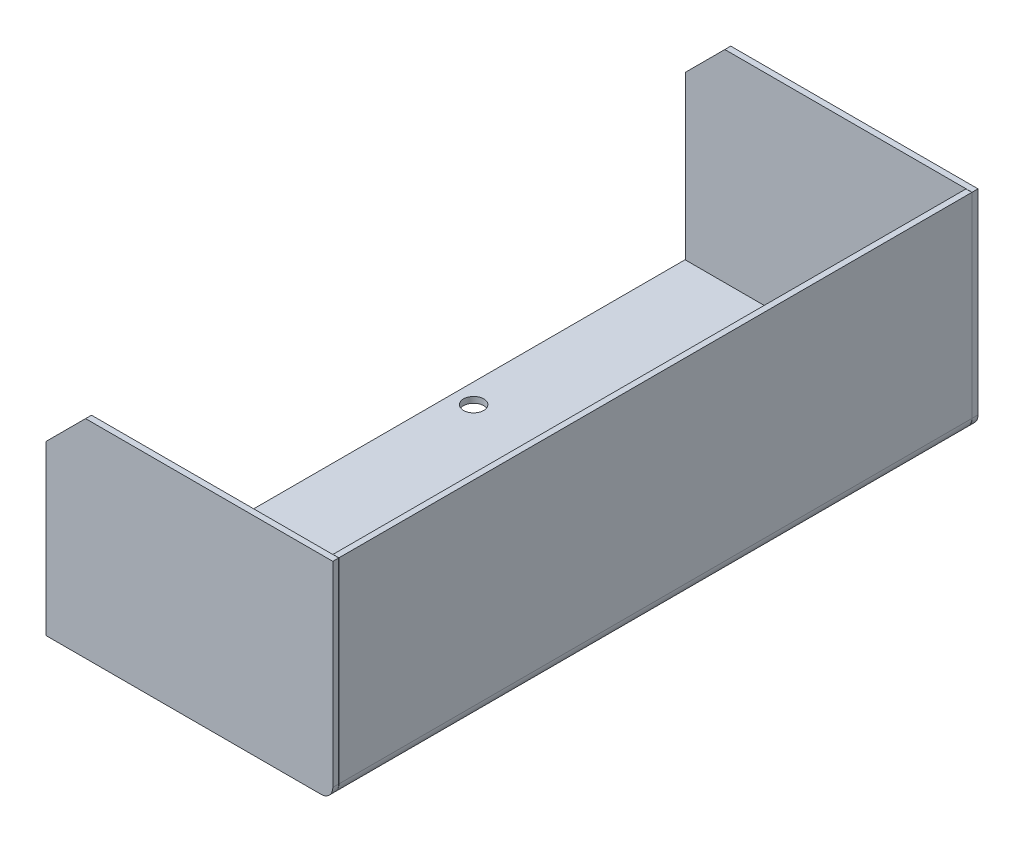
from build123d import *

# Parameters (mm, degrees)
EXTRUSION1_DEPTH        = 320
EXTRUSION2_START        = 3
EXTRUSION2_DEPTH        = 3
EXTRUSION3_DEPTH        = 3
ESQUISSE4_R             = 4.1
ESQUISSE4_R_2           = 5.1
ENL_V_MAT_EXTRU_1_DEPTH = 3
CHANFREIN1_SIZE         = 20
CHANFREIN2_SIZE         = 20


with BuildPart() as part:
    # Esquisse1 → Extrusion1 (new body)
    with BuildSketch(Plane.XY):
        with BuildLine():
            Line((-143.5, -1.5), (-4.5, -1.5))
            ThreePointArc((-4.5, -1.5), (-0.257359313, 0.257359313), (1.5, 4.5))
            Line((1.5, 4.5), (1.5, 103.5))
            Line((1.5, 103.5), (-1.5, 103.5))
            Line((-1.5, 103.5), (-1.5, 4.5))
            ThreePointArc((-1.5, 4.5), (-2.378679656, 2.378679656), (-4.5, 1.5))
            Line((-4.5, 1.5), (-143.5, 1.5))
            Line((-143.5, 1.5), (-143.5, -1.5))
        make_face()
    extrude(amount=EXTRUSION1_DEPTH)

    # Esquisse4 → Enl_v. mat.-Extru.1 (cut)
    with BuildSketch(Plane.XZ.offset(1.5)):
        with Locations((-101, 266.9)):
            Circle(ESQUISSE4_R)
        with Locations((-133.5, 116.9)):
            Circle(ESQUISSE4_R_2)
        with Locations((-61, 13.9)):
            Circle(ESQUISSE4_R)
    extrude(amount=-ENL_V_MAT_EXTRU_1_DEPTH, mode=Mode.SUBTRACT)


with BuildPart() as body_2:
    # Esquisse2 → Extrusion2 (new body)
    with BuildSketch(Plane(origin=(0, 0, -0.1), x_dir=(-1, 0, 0), z_dir=(0, 0, -1)).offset(EXTRUSION2_START)):
        with BuildLine():
            Line((-1.5, 103.5), (143.5, 103.5))
            Line((143.5, 103.5), (143.5, -1.5))
            Line((143.5, -1.5), (4.5, -1.5))
            ThreePointArc((4.5, -1.5), (0.257359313, 0.257359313), (-1.5, 4.5))
            Line((-1.5, 4.5), (-1.5, 103.5))
        make_face()
    extrude(amount=-EXTRUSION2_DEPTH)

    # Chanfrein1
    chanfrein1_edges = [body_2.edges().sort_by_distance(p)[0] for p in [
        (-143.5, 103.5, -1.6),
    ]]
    chamfer(chanfrein1_edges, length=CHANFREIN1_SIZE)


with BuildPart() as body_3:
    # Esquisse3 → Extrusion3 (new body)
    with BuildSketch(Plane.XY.offset(320.1)):
        with BuildLine():
            Line((-4.5, -1.5), (-143.5, -1.5))
            Line((-143.5, -1.5), (-143.5, 103.5))
            Line((-143.5, 103.5), (1.5, 103.5))
            Line((1.5, 103.5), (1.5, 4.5))
            ThreePointArc((1.5, 4.5), (-0.257359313, 0.257359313), (-4.5, -1.5))
        make_face()
    extrude(amount=EXTRUSION3_DEPTH)

    # Chanfrein2
    chanfrein2_edges = [body_3.edges().sort_by_distance(p)[0] for p in [
        (-143.5, 103.5, 321.6),
    ]]
    chamfer(chanfrein2_edges, length=CHANFREIN2_SIZE)


solid = Compound([part.part, body_2.part, body_3.part])
